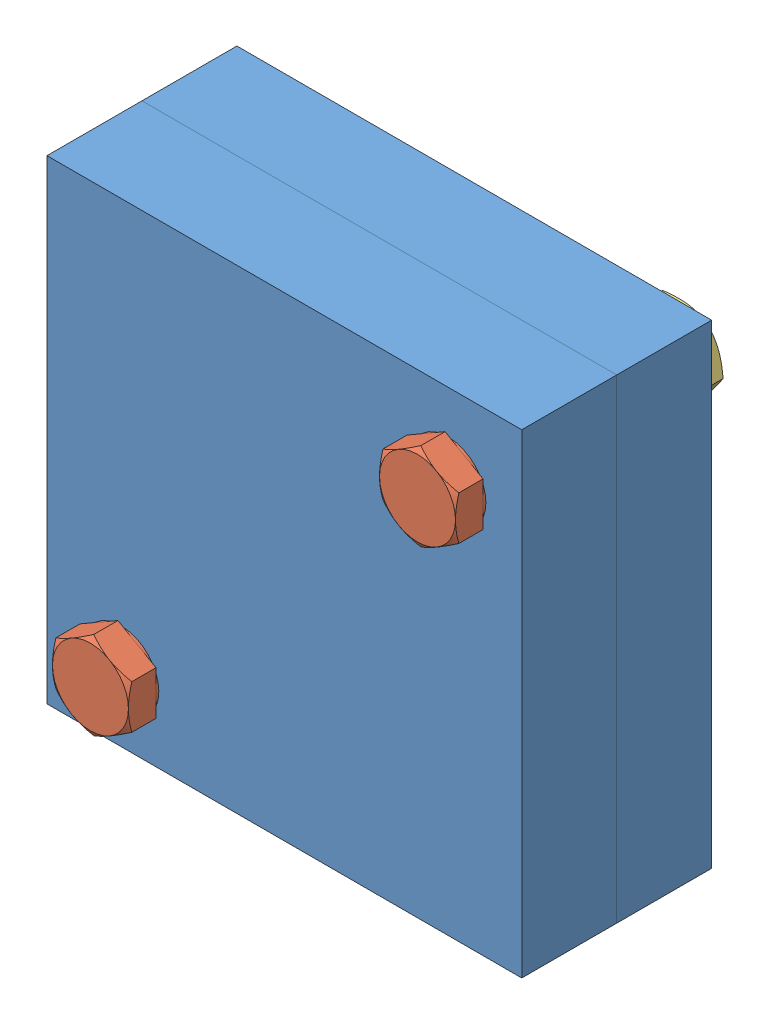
SolidWorks assembly blocks.SLDASM, configuration Default (file format 4100). Lengths in mm.
Overall size (100 100 56.4).
6 component instances, 3 part files, 11 mates.
Components (placement in the parent):
- block-1: block.SLDPRT [Default] at (-6.7979 8.0463 -1.8794) size (100 100 20)
- block-2: block.SLDPRT [Default] at (-6.7979 8.0463 -21.8794) size (100 100 20)
- Hex Bolt GradeAB_ISO-4: Hex Bolt GradeAB_ISO.SLDPRT [ISO 4014 - M10 x 50 x 26-N] at (-41.243 -27.9014 24.5206) x (0 0 -1) z (1 0 0) size (56.4 18.48 16)
- Hex Bolt GradeAB_ISO-5: Hex Bolt GradeAB_ISO.SLDPRT [ISO 4014 - M10 x 50 x 26-N] at (27.6472 40.9887 24.5206) x (0 0 -1) z (1 0 0) size (56.4 18.48 16)
- Hex Nut GradeC_ISO-4: Hex Nut GradeC_ISO.SLDPRT [Hexagon Nut ISO - 4034 - M10 - N] at (-41.243 -27.9014 -31.3794) x (0.923728 0.383049 0) z (0 0 -1) size (16 18.48 9.5)
- Hex Nut GradeC_ISO-5: Hex Nut GradeC_ISO.SLDPRT [Hexagon Nut ISO - 4034 - M10 - N] at (27.6472 40.9887 -31.3794) x (0.923728 0.383049 0) z (0 0 -1) size (16 18.48 9.5)
Mates (geometry in assembly coordinates):
- Coincident1: coincident aligned: plane of block-1 through (43.2021 58.0463 18.1206) normal (1 0 0); plane of block-2 through (43.2021 58.0463 -1.8794) normal (1 0 0)
- Coincident2: coincident aligned: plane of block-1 through (-56.7979 58.0463 18.1206) normal (0 1 0); plane of block-2 through (-56.7979 58.0463 -1.8794) normal (0 1 0)
- Coincident3: coincident anti-aligned: plane of block-1 through (-56.7979 -41.9537 -1.8794) normal (0 0 -1); plane of block-2 through (-56.7979 -41.9537 -1.8794) normal (0 0 1)
- Concentric1: concentric aligned: cylinder of block-1 through (-41.243 -27.9014 18.1206) axis (0 0 1) radius 6; cylinder of Hex Bolt GradeAB_ISO-4 through (-41.243 -27.9014 24.5206) axis (0 0 1) radius 5
- Coincident4: coincident anti-aligned: plane of block-1 through (-56.7979 -41.9537 18.1206) normal (0 0 1); plane of Hex Bolt GradeAB_ISO-4 through (-41.243 -18.6638 18.1206) normal (0 0 -1)
- Concentric2: concentric aligned: cylinder of block-1 through (27.6472 40.9887 18.1206) axis (0 0 1) radius 6; cylinder of Hex Bolt GradeAB_ISO-5 through (27.6472 40.9887 24.5206) axis (0 0 1) radius 8
- Coincident5: coincident anti-aligned: plane of block-1 through (-56.7979 -41.9537 18.1206) normal (0 0 1); plane of Hex Bolt GradeAB_ISO-5 through (27.6472 50.2264 18.1206) normal (0 0 -1)
- Concentric3: concentric anti-aligned: cylinder of Hex Bolt GradeAB_ISO-4 through (-41.243 -27.9014 24.5206) axis (0 0 1) radius 5; cylinder of Hex Nut GradeC_ISO-4 through (-41.243 -27.9014 -6.3419) axis (0 0 -1) radius 5
- Coincident6: coincident anti-aligned: plane of block-2 through (-56.7979 -41.9537 -21.8794) normal (0 0 -1); plane of Hex Nut GradeC_ISO-4 through (-37.7045 -36.4344 -21.8794) normal (0 0 1)
- Concentric4: concentric anti-aligned: cylinder of block-2 through (27.6472 40.9887 -1.8794) axis (0 0 1) radius 6; cylinder of Hex Nut GradeC_ISO-5 through (27.6472 40.9887 -6.3419) axis (0 0 -1) radius 5
- Coincident7: coincident anti-aligned: plane of block-2 through (-56.7979 -41.9537 -21.8794) normal (0 0 -1); plane of Hex Nut GradeC_ISO-5 through (31.1856 32.4557 -21.8794) normal (0 0 1)
